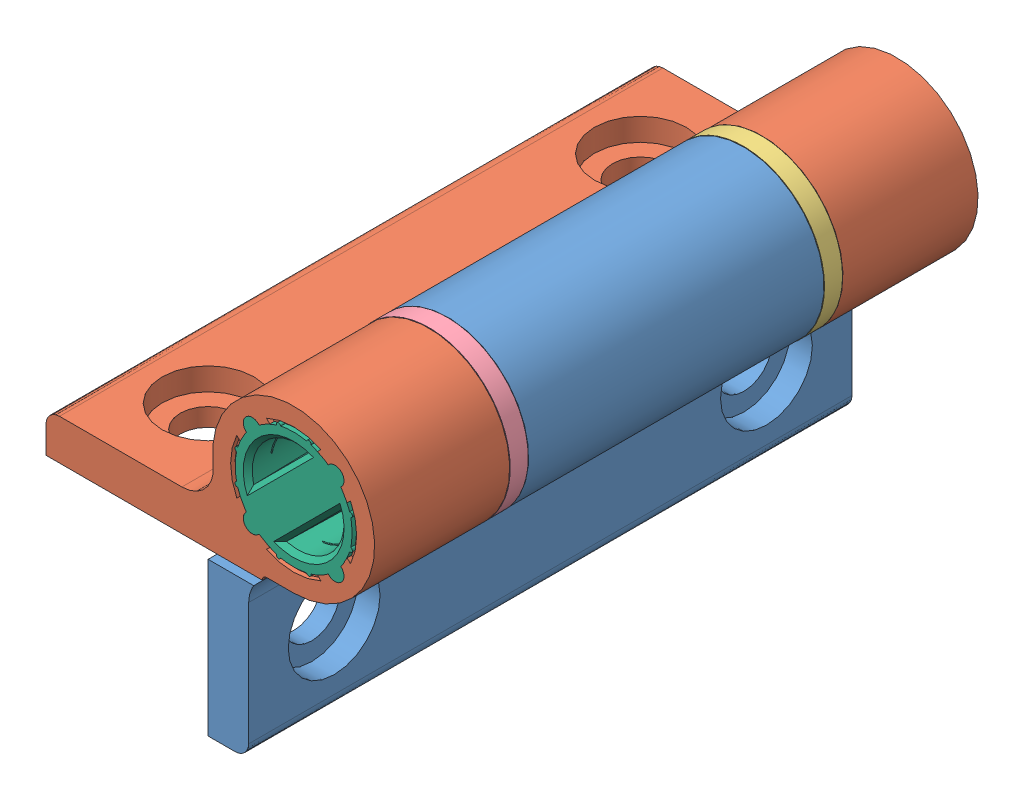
SolidWorks assembly 72-1-4218_Temp.SLDASM, configuration Default (file format 4100). Lengths in mm.
Overall size (36.5 36.5 67).
7 component instances, 7 part files, 0 mates.
Components (placement in the parent):
- 72-1-4218_01-1: 72-1-4218_01.SLDPRT [Default] at origin size (18.5 36.5 67)
- 72-1-4218_02-1: 72-1-4218_02.SLDPRT [Default] at origin size (36.5 18.5 67)
- 72-1-4218_03-1: 72-1-4218_03.SLDPRT [Default] at origin size (18 18 2)
- 72-1-4218_04-1: 72-1-4218_04.SLDPRT [Default] at origin size (18 18 2)
- 72-1-4218_05-1: 72-1-4218_05.SLDPRT [Default] at origin size (13.06 13.06 32)
- 72-1-4218_06-1: 72-1-4218_06.SLDPRT [Default] at origin size (13.06 13.06 34)
- 72-1-4218_07-1: 72-1-4218_07.SLDPRT [Default] at origin size (9 0.1 9)
